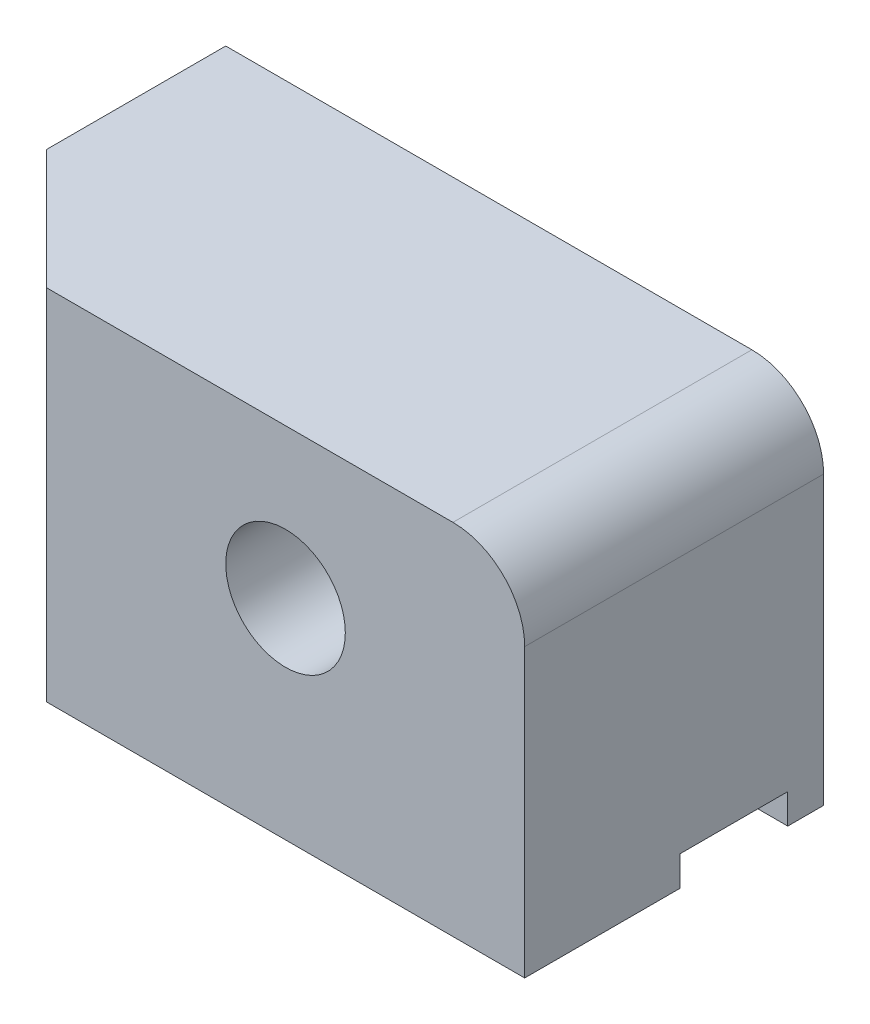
ISO-10303-21;
HEADER;
FILE_DESCRIPTION(('STEP AP214'),'2;1');
FILE_NAME('part.step','',(''),(''),'','','');
FILE_SCHEMA(('AUTOMOTIVE_DESIGN { 1 0 10303 214 1 1 1 1 }'));
ENDSEC;
DATA;
#1=APPLICATION_CONTEXT('core data for automotive mechanical design processes');
#2=APPLICATION_PROTOCOL_DEFINITION('international standard','automotive_design',2000,#1);
#3=PRODUCT_CONTEXT('',#1,'mechanical');
#4=PRODUCT('Part','Part','',(#3));
#5=PRODUCT_RELATED_PRODUCT_CATEGORY('part','',(#4));
#6=PRODUCT_DEFINITION_FORMATION('','',#4);
#7=PRODUCT_DEFINITION_CONTEXT('part definition',#1,'design');
#8=PRODUCT_DEFINITION('design','',#6,#7);
#9=PRODUCT_DEFINITION_SHAPE('','',#8);
#10=(LENGTH_UNIT() NAMED_UNIT(*) SI_UNIT(.MILLI.,.METRE.));
#11=(NAMED_UNIT(*) PLANE_ANGLE_UNIT() SI_UNIT($,.RADIAN.));
#12=(NAMED_UNIT(*) SI_UNIT($,.STERADIAN.) SOLID_ANGLE_UNIT());
#13=UNCERTAINTY_MEASURE_WITH_UNIT(LENGTH_MEASURE(1.E-05),#10,'distance_accuracy_value','');
#14=(GEOMETRIC_REPRESENTATION_CONTEXT(3) GLOBAL_UNCERTAINTY_ASSIGNED_CONTEXT((#13)) GLOBAL_UNIT_ASSIGNED_CONTEXT((#10,
#11,#12)) REPRESENTATION_CONTEXT('',''));
#15=CARTESIAN_POINT('',(0.,0.,0.));
#16=DIRECTION('',(0.,0.,1.));
#17=DIRECTION('',(1.,0.,0.));
#18=AXIS2_PLACEMENT_3D('',#15,#16,#17);
#19=CARTESIAN_POINT('',(0.,0.,50.));
#20=DIRECTION('',(0.,1.,0.));
#21=DIRECTION('',(0.,0.,1.));
#22=AXIS2_PLACEMENT_3D('',#19,#20,#21);
#23=PLANE('',#22);
#24=DIRECTION('',(0.,0.,-1.));
#25=VECTOR('',#24,1.);
#26=CARTESIAN_POINT('',(100.,0.,50.));
#27=LINE('',#26,#25);
#28=CARTESIAN_POINT('',(100.,0.,6.));
#29=VERTEX_POINT('',#28);
#30=CARTESIAN_POINT('',(100.,0.,0.));
#31=VERTEX_POINT('',#30);
#32=EDGE_CURVE('E170',#29,#31,#27,.T.);
#33=ORIENTED_EDGE('',*,*,#32,.F.);
#34=DIRECTION('',(1.,0.,0.));
#35=VECTOR('',#34,1.);
#36=CARTESIAN_POINT('',(0.,0.,6.));
#37=LINE('',#36,#35);
#38=CARTESIAN_POINT('',(0.,0.,6.));
#39=VERTEX_POINT('',#38);
#40=EDGE_CURVE('E137',#39,#29,#37,.T.);
#41=ORIENTED_EDGE('',*,*,#40,.F.);
#42=DIRECTION('',(0.,0.,-1.));
#43=VECTOR('',#42,1.);
#44=CARTESIAN_POINT('',(0.,0.,50.));
#45=LINE('',#44,#43);
#46=CARTESIAN_POINT('',(0.,0.,0.));
#47=VERTEX_POINT('',#46);
#48=EDGE_CURVE('E128',#39,#47,#45,.T.);
#49=ORIENTED_EDGE('',*,*,#48,.T.);
#50=DIRECTION('',(1.,0.,0.));
#51=VECTOR('',#50,1.);
#52=CARTESIAN_POINT('',(0.,0.,0.));
#53=LINE('',#52,#51);
#54=EDGE_CURVE('E161',#47,#31,#53,.T.);
#55=ORIENTED_EDGE('',*,*,#54,.T.);
#56=EDGE_LOOP('',(#33,#41,#49,#55));
#57=FACE_BOUND('',#56,.T.);
#58=ADVANCED_FACE('F31',(#57),#23,.F.);
#59=CARTESIAN_POINT('',(0.,0.,50.));
#60=DIRECTION('',(1.,0.,0.));
#61=DIRECTION('',(0.,0.,-1.));
#62=AXIS2_PLACEMENT_3D('',#59,#60,#61);
#63=PLANE('',#62);
#64=CARTESIAN_POINT('',(0.,0.,29.9999999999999));
#65=VERTEX_POINT('',#64);
#66=CARTESIAN_POINT('',(0.,0.,24.));
#67=VERTEX_POINT('',#66);
#68=EDGE_CURVE('E174',#65,#67,#45,.T.);
#69=ORIENTED_EDGE('',*,*,#68,.F.);
#70=DIRECTION('',(0.,1.,0.));
#71=VECTOR('',#70,1.);
#72=CARTESIAN_POINT('',(0.,0.,29.9999999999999));
#73=LINE('',#72,#71);
#74=CARTESIAN_POINT('',(0.,60.,29.9999999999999));
#75=VERTEX_POINT('',#74);
#76=EDGE_CURVE('E39',#65,#75,#73,.T.);
#77=ORIENTED_EDGE('',*,*,#76,.T.);
#78=DIRECTION('',(0.,0.,-1.));
#79=VECTOR('',#78,1.);
#80=CARTESIAN_POINT('',(0.,60.,50.));
#81=LINE('',#80,#79);
#82=CARTESIAN_POINT('',(0.,60.,0.));
#83=VERTEX_POINT('',#82);
#84=EDGE_CURVE('E159',#75,#83,#81,.T.);
#85=ORIENTED_EDGE('',*,*,#84,.T.);
#86=DIRECTION('',(0.,-1.,0.));
#87=VECTOR('',#86,1.);
#88=CARTESIAN_POINT('',(0.,0.,0.));
#89=LINE('',#88,#87);
#90=EDGE_CURVE('E147',#83,#47,#89,.T.);
#91=ORIENTED_EDGE('',*,*,#90,.T.);
#92=ORIENTED_EDGE('',*,*,#48,.F.);
#93=DIRECTION('',(0.,1.,0.));
#94=VECTOR('',#93,1.);
#95=CARTESIAN_POINT('',(0.,0.,6.));
#96=LINE('',#95,#94);
#97=CARTESIAN_POINT('',(0.,5.,6.));
#98=VERTEX_POINT('',#97);
#99=EDGE_CURVE('E109',#39,#98,#96,.T.);
#100=ORIENTED_EDGE('',*,*,#99,.T.);
#101=DIRECTION('',(0.,0.,1.));
#102=VECTOR('',#101,1.);
#103=CARTESIAN_POINT('',(0.,5.,6.));
#104=LINE('',#103,#102);
#105=CARTESIAN_POINT('',(0.,5.,24.));
#106=VERTEX_POINT('',#105);
#107=EDGE_CURVE('E120',#98,#106,#104,.T.);
#108=ORIENTED_EDGE('',*,*,#107,.T.);
#109=DIRECTION('',(0.,-1.,0.));
#110=VECTOR('',#109,1.);
#111=CARTESIAN_POINT('',(0.,0.,24.));
#112=LINE('',#111,#110);
#113=EDGE_CURVE('E117',#106,#67,#112,.T.);
#114=ORIENTED_EDGE('',*,*,#113,.T.);
#115=EDGE_LOOP('',(#69,#77,#85,#91,#92,#100,#108,#114));
#116=FACE_BOUND('',#115,.T.);
#117=ADVANCED_FACE('F126',(#116),#63,.F.);
#118=DIRECTION('',(1.,0.,0.));
#119=VECTOR('',#118,1.);
#120=CARTESIAN_POINT('',(0.,0.,50.));
#121=LINE('',#120,#119);
#122=CARTESIAN_POINT('',(20.,0.,50.));
#123=VERTEX_POINT('',#122);
#124=CARTESIAN_POINT('',(100.,0.,50.));
#125=VERTEX_POINT('',#124);
#126=EDGE_CURVE('E150',#123,#125,#121,.T.);
#127=ORIENTED_EDGE('',*,*,#126,.F.);
#128=DIRECTION('',(0.707106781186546,0.,0.707106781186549));
#129=VECTOR('',#128,1.);
#130=CARTESIAN_POINT('',(20.,0.,50.));
#131=LINE('',#130,#129);
#132=EDGE_CURVE('E53',#123,#65,#131,.F.);
#133=ORIENTED_EDGE('',*,*,#132,.T.);
#134=ORIENTED_EDGE('',*,*,#68,.T.);
#135=DIRECTION('',(1.,0.,0.));
#136=VECTOR('',#135,1.);
#137=CARTESIAN_POINT('',(0.,0.,24.));
#138=LINE('',#137,#136);
#139=CARTESIAN_POINT('',(100.,0.,24.));
#140=VERTEX_POINT('',#139);
#141=EDGE_CURVE('E140',#67,#140,#138,.T.);
#142=ORIENTED_EDGE('',*,*,#141,.T.);
#143=EDGE_CURVE('E171',#125,#140,#27,.T.);
#144=ORIENTED_EDGE('',*,*,#143,.F.);
#145=EDGE_LOOP('',(#127,#133,#134,#142,#144));
#146=FACE_BOUND('',#145,.T.);
#147=ADVANCED_FACE('F195',(#146),#23,.F.);
#148=CARTESIAN_POINT('',(100.,0.,50.));
#149=DIRECTION('',(-1.,0.,0.));
#150=DIRECTION('',(0.,0.,1.));
#151=AXIS2_PLACEMENT_3D('',#148,#149,#150);
#152=PLANE('',#151);
#153=DIRECTION('',(0.,1.,0.));
#154=VECTOR('',#153,1.);
#155=CARTESIAN_POINT('',(100.,0.,0.));
#156=LINE('',#155,#154);
#157=CARTESIAN_POINT('',(100.,48.,0.));
#158=VERTEX_POINT('',#157);
#159=EDGE_CURVE('E164',#31,#158,#156,.T.);
#160=ORIENTED_EDGE('',*,*,#159,.T.);
#161=DIRECTION('',(0.,0.,-1.));
#162=VECTOR('',#161,1.);
#163=CARTESIAN_POINT('',(100.,48.,50.));
#164=LINE('',#163,#162);
#165=CARTESIAN_POINT('',(100.,48.,50.));
#166=VERTEX_POINT('',#165);
#167=EDGE_CURVE('E181',#158,#166,#164,.F.);
#168=ORIENTED_EDGE('',*,*,#167,.T.);
#169=DIRECTION('',(0.,1.,0.));
#170=VECTOR('',#169,1.);
#171=CARTESIAN_POINT('',(100.,0.,50.));
#172=LINE('',#171,#170);
#173=EDGE_CURVE('E152',#125,#166,#172,.T.);
#174=ORIENTED_EDGE('',*,*,#173,.F.);
#175=ORIENTED_EDGE('',*,*,#143,.T.);
#176=DIRECTION('',(0.,-1.,0.));
#177=VECTOR('',#176,1.);
#178=CARTESIAN_POINT('',(100.,0.,24.));
#179=LINE('',#178,#177);
#180=CARTESIAN_POINT('',(100.,5.,24.));
#181=VERTEX_POINT('',#180);
#182=EDGE_CURVE('E129',#181,#140,#179,.T.);
#183=ORIENTED_EDGE('',*,*,#182,.F.);
#184=DIRECTION('',(0.,0.,1.));
#185=VECTOR('',#184,1.);
#186=CARTESIAN_POINT('',(100.,5.,6.));
#187=LINE('',#186,#185);
#188=CARTESIAN_POINT('',(100.,5.,6.00000000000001));
#189=VERTEX_POINT('',#188);
#190=EDGE_CURVE('E131',#189,#181,#187,.T.);
#191=ORIENTED_EDGE('',*,*,#190,.F.);
#192=DIRECTION('',(0.,1.,0.));
#193=VECTOR('',#192,1.);
#194=CARTESIAN_POINT('',(100.,0.,6.));
#195=LINE('',#194,#193);
#196=EDGE_CURVE('E112',#29,#189,#195,.T.);
#197=ORIENTED_EDGE('',*,*,#196,.F.);
#198=ORIENTED_EDGE('',*,*,#32,.T.);
#199=EDGE_LOOP('',(#160,#168,#174,#175,#183,#191,#197,#198));
#200=FACE_BOUND('',#199,.T.);
#201=ADVANCED_FACE('F200',(#200),#152,.F.);
#202=CARTESIAN_POINT('',(0.,60.,50.));
#203=DIRECTION('',(0.,-1.,0.));
#204=DIRECTION('',(0.,0.,-1.));
#205=AXIS2_PLACEMENT_3D('',#202,#203,#204);
#206=PLANE('',#205);
#207=ORIENTED_EDGE('',*,*,#84,.F.);
#208=DIRECTION('',(-0.707106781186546,0.,-0.707106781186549));
#209=VECTOR('',#208,1.);
#210=CARTESIAN_POINT('',(20.,60.,50.));
#211=LINE('',#210,#209);
#212=CARTESIAN_POINT('',(20.,60.,50.));
#213=VERTEX_POINT('',#212);
#214=EDGE_CURVE('E11',#75,#213,#211,.F.);
#215=ORIENTED_EDGE('',*,*,#214,.T.);
#216=DIRECTION('',(-1.,0.,0.));
#217=VECTOR('',#216,1.);
#218=CARTESIAN_POINT('',(0.,60.,50.));
#219=LINE('',#218,#217);
#220=CARTESIAN_POINT('',(88.,60.,50.));
#221=VERTEX_POINT('',#220);
#222=EDGE_CURVE('E156',#221,#213,#219,.T.);
#223=ORIENTED_EDGE('',*,*,#222,.F.);
#224=DIRECTION('',(0.,0.,-1.));
#225=VECTOR('',#224,1.);
#226=CARTESIAN_POINT('',(88.,60.,50.));
#227=LINE('',#226,#225);
#228=CARTESIAN_POINT('',(88.,60.,0.));
#229=VERTEX_POINT('',#228);
#230=EDGE_CURVE('E176',#221,#229,#227,.T.);
#231=ORIENTED_EDGE('',*,*,#230,.T.);
#232=DIRECTION('',(-1.,0.,0.));
#233=VECTOR('',#232,1.);
#234=CARTESIAN_POINT('',(0.,60.,0.));
#235=LINE('',#234,#233);
#236=EDGE_CURVE('E153',#229,#83,#235,.T.);
#237=ORIENTED_EDGE('',*,*,#236,.T.);
#238=EDGE_LOOP('',(#207,#215,#223,#231,#237));
#239=FACE_BOUND('',#238,.T.);
#240=ADVANCED_FACE('F208',(#239),#206,.F.);
#241=CARTESIAN_POINT('',(0.,60.,50.));
#242=DIRECTION('',(0.,0.,-1.));
#243=DIRECTION('',(-1.,0.,0.));
#244=AXIS2_PLACEMENT_3D('',#241,#242,#243);
#245=PLANE('',#244);
#246=CARTESIAN_POINT('',(60.,35.,50.));
#247=DIRECTION('',(0.,0.,1.));
#248=DIRECTION('',(1.,0.,0.));
#249=AXIS2_PLACEMENT_3D('',#246,#247,#248);
#250=CIRCLE('',#249,9.99999999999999);
#251=CARTESIAN_POINT('',(70.,35.,50.));
#252=VERTEX_POINT('',#251);
#253=EDGE_CURVE('E139',#252,#252,#250,.T.);
#254=ORIENTED_EDGE('',*,*,#253,.F.);
#255=EDGE_LOOP('',(#254));
#256=FACE_BOUND('',#255,.T.);
#257=ORIENTED_EDGE('',*,*,#222,.T.);
#258=DIRECTION('',(0.,-1.,0.));
#259=VECTOR('',#258,1.);
#260=CARTESIAN_POINT('',(20.,60.,50.));
#261=LINE('',#260,#259);
#262=EDGE_CURVE('E185',#213,#123,#261,.T.);
#263=ORIENTED_EDGE('',*,*,#262,.T.);
#264=ORIENTED_EDGE('',*,*,#126,.T.);
#265=ORIENTED_EDGE('',*,*,#173,.T.);
#266=CARTESIAN_POINT('',(88.,48.,50.));
#267=DIRECTION('',(0.,0.,-1.));
#268=DIRECTION('',(-1.,0.,0.));
#269=AXIS2_PLACEMENT_3D('',#266,#267,#268);
#270=CIRCLE('',#269,12.);
#271=EDGE_CURVE('E183',#166,#221,#270,.F.);
#272=ORIENTED_EDGE('',*,*,#271,.T.);
#273=EDGE_LOOP('',(#257,#263,#264,#265,#272));
#274=FACE_BOUND('',#273,.T.);
#275=ADVANCED_FACE('F190',(#256,#274),#245,.F.);
#276=CARTESIAN_POINT('',(0.,60.,0.));
#277=DIRECTION('',(0.,0.,-1.));
#278=DIRECTION('',(-1.,0.,0.));
#279=AXIS2_PLACEMENT_3D('',#276,#277,#278);
#280=PLANE('',#279);
#281=CARTESIAN_POINT('',(60.,35.,0.));
#282=DIRECTION('',(0.,0.,1.));
#283=DIRECTION('',(1.,0.,0.));
#284=AXIS2_PLACEMENT_3D('',#281,#282,#283);
#285=CIRCLE('',#284,9.99999999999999);
#286=CARTESIAN_POINT('',(70.,35.,0.));
#287=VERTEX_POINT('',#286);
#288=EDGE_CURVE('E144',#287,#287,#285,.T.);
#289=ORIENTED_EDGE('',*,*,#288,.T.);
#290=EDGE_LOOP('',(#289));
#291=FACE_BOUND('',#290,.T.);
#292=ORIENTED_EDGE('',*,*,#236,.F.);
#293=CARTESIAN_POINT('',(88.,48.,0.));
#294=DIRECTION('',(0.,0.,-1.));
#295=DIRECTION('',(-1.,0.,0.));
#296=AXIS2_PLACEMENT_3D('',#293,#294,#295);
#297=CIRCLE('',#296,12.);
#298=EDGE_CURVE('E179',#229,#158,#297,.T.);
#299=ORIENTED_EDGE('',*,*,#298,.T.);
#300=ORIENTED_EDGE('',*,*,#159,.F.);
#301=ORIENTED_EDGE('',*,*,#54,.F.);
#302=ORIENTED_EDGE('',*,*,#90,.F.);
#303=EDGE_LOOP('',(#292,#299,#300,#301,#302));
#304=FACE_BOUND('',#303,.T.);
#305=ADVANCED_FACE('F211',(#291,#304),#280,.T.);
#306=CARTESIAN_POINT('',(60.,35.,0.));
#307=DIRECTION('',(0.,0.,1.));
#308=DIRECTION('',(1.,0.,0.));
#309=AXIS2_PLACEMENT_3D('',#306,#307,#308);
#310=CYLINDRICAL_SURFACE('',#309,9.99999999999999);
#311=ORIENTED_EDGE('',*,*,#288,.F.);
#312=EDGE_LOOP('',(#311));
#313=FACE_BOUND('',#312,.T.);
#314=ORIENTED_EDGE('',*,*,#253,.T.);
#315=EDGE_LOOP('',(#314));
#316=FACE_BOUND('',#315,.T.);
#317=ADVANCED_FACE('F238',(#313,#316),#310,.F.);
#318=CARTESIAN_POINT('',(0.,0.,6.));
#319=DIRECTION('',(0.,0.,-1.));
#320=DIRECTION('',(0.,1.,0.));
#321=AXIS2_PLACEMENT_3D('',#318,#319,#320);
#322=PLANE('',#321);
#323=ORIENTED_EDGE('',*,*,#196,.T.);
#324=DIRECTION('',(1.,0.,0.));
#325=VECTOR('',#324,1.);
#326=CARTESIAN_POINT('',(0.,5.,6.));
#327=LINE('',#326,#325);
#328=EDGE_CURVE('E105',#98,#189,#327,.T.);
#329=ORIENTED_EDGE('',*,*,#328,.F.);
#330=ORIENTED_EDGE('',*,*,#99,.F.);
#331=ORIENTED_EDGE('',*,*,#40,.T.);
#332=EDGE_LOOP('',(#323,#329,#330,#331));
#333=FACE_BOUND('',#332,.T.);
#334=ADVANCED_FACE('F107',(#333),#322,.F.);
#335=CARTESIAN_POINT('',(0.,0.,24.));
#336=DIRECTION('',(0.,0.,1.));
#337=DIRECTION('',(1.,0.,0.));
#338=AXIS2_PLACEMENT_3D('',#335,#336,#337);
#339=PLANE('',#338);
#340=ORIENTED_EDGE('',*,*,#182,.T.);
#341=ORIENTED_EDGE('',*,*,#141,.F.);
#342=ORIENTED_EDGE('',*,*,#113,.F.);
#343=DIRECTION('',(1.,0.,0.));
#344=VECTOR('',#343,1.);
#345=CARTESIAN_POINT('',(0.,5.,24.));
#346=LINE('',#345,#344);
#347=EDGE_CURVE('E116',#106,#181,#346,.T.);
#348=ORIENTED_EDGE('',*,*,#347,.T.);
#349=EDGE_LOOP('',(#340,#341,#342,#348));
#350=FACE_BOUND('',#349,.T.);
#351=ADVANCED_FACE('F248',(#350),#339,.F.);
#352=CARTESIAN_POINT('',(0.,5.,6.));
#353=DIRECTION('',(0.,1.,0.));
#354=DIRECTION('',(0.,0.,1.));
#355=AXIS2_PLACEMENT_3D('',#352,#353,#354);
#356=PLANE('',#355);
#357=ORIENTED_EDGE('',*,*,#190,.T.);
#358=ORIENTED_EDGE('',*,*,#347,.F.);
#359=ORIENTED_EDGE('',*,*,#107,.F.);
#360=ORIENTED_EDGE('',*,*,#328,.T.);
#361=EDGE_LOOP('',(#357,#358,#359,#360));
#362=FACE_BOUND('',#361,.T.);
#363=ADVANCED_FACE('F121',(#362),#356,.F.);
#364=CARTESIAN_POINT('',(88.,48.,50.));
#365=DIRECTION('',(0.,0.,-1.));
#366=DIRECTION('',(-1.,0.,0.));
#367=AXIS2_PLACEMENT_3D('',#364,#365,#366);
#368=CYLINDRICAL_SURFACE('',#367,12.);
#369=ORIENTED_EDGE('',*,*,#271,.F.);
#370=ORIENTED_EDGE('',*,*,#167,.F.);
#371=ORIENTED_EDGE('',*,*,#298,.F.);
#372=ORIENTED_EDGE('',*,*,#230,.F.);
#373=EDGE_LOOP('',(#369,#370,#371,#372));
#374=FACE_BOUND('',#373,.T.);
#375=ADVANCED_FACE('F205',(#374),#368,.T.);
#376=CARTESIAN_POINT('',(20.,60.,50.));
#377=DIRECTION('',(0.707106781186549,0.,-0.707106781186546));
#378=DIRECTION('',(-0.707106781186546,0.,-0.707106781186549));
#379=AXIS2_PLACEMENT_3D('',#376,#377,#378);
#380=PLANE('',#379);
#381=ORIENTED_EDGE('',*,*,#214,.F.);
#382=ORIENTED_EDGE('',*,*,#76,.F.);
#383=ORIENTED_EDGE('',*,*,#132,.F.);
#384=ORIENTED_EDGE('',*,*,#262,.F.);
#385=EDGE_LOOP('',(#381,#382,#383,#384));
#386=FACE_BOUND('',#385,.T.);
#387=ADVANCED_FACE('F33',(#386),#380,.F.);
#388=CLOSED_SHELL('',(#58,#117,#147,#201,#240,#275,#305,#317,#334,#351,#363,#375,#387));
#389=MANIFOLD_SOLID_BREP('B2',#388);
#390=ADVANCED_BREP_SHAPE_REPRESENTATION('',(#18,#389),#14);
#391=SHAPE_DEFINITION_REPRESENTATION(#9,#390);
ENDSEC;
END-ISO-10303-21;
